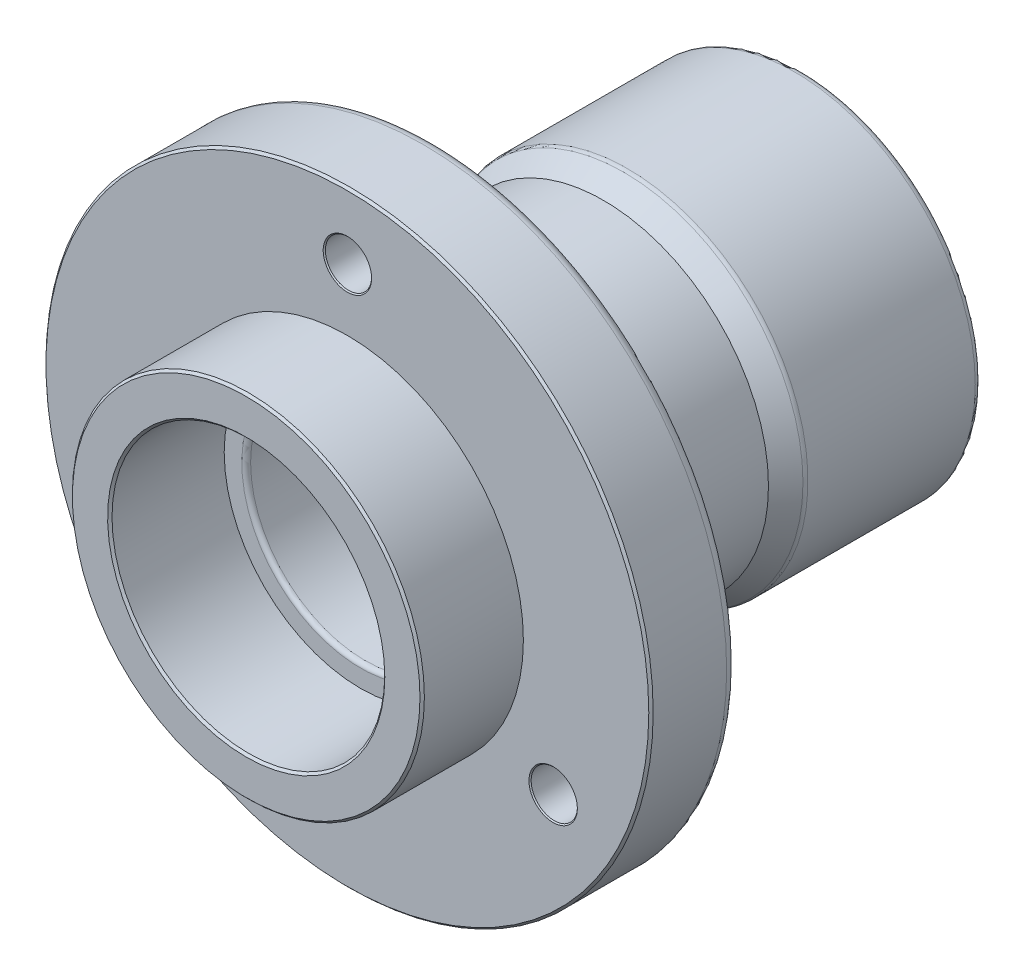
from build123d import *

# Parameters (mm, degrees)
ESQUISSE1_R                               = 41
EXTRUSION1_DEPTH                          = 40
ESQUISSE12_R                              = 37.5
EXTRUSION2_DEPTH                          = 35
ESQUISSE17_R                              = 69
EXTRUSION3_DEPTH                          = 19.7
ESQUISSE18_R                              = 40
EXTRUSION4_DEPTH                          = 23
ESQUISSE20_R                              = 5.25
ENL_V_MAT_EXTRU_1_DEPTH                   = 129.429941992
CHANFREIN4_SIZE                           = 0.25
R_P_TITION_CIRCULAIRE1_COUNT              = 3
CHANFREIN4_OF_R_P_TITION_CIRCULAIRE1_SIZE = 0.25
CONG_1_R                                  = 1.5
CONG_2_R                                  = 1.5
CONG_5_R                                  = 1
CONG_7_R                                  = 2.5
ESQUISSE25_R                              = 36
EXTRUSION5_DEPTH                          = 10
CHANFREIN1_SIZE                           = 0.5


with BuildPart() as part:
    # Esquisse1 → Extrusion1 (new body)
    with BuildSketch(Plane.XY):
        Circle(ESQUISSE1_R)
    extrude(amount=EXTRUSION1_DEPTH)

    # Esquisse9 → R_volution4 (revolve)
    with BuildSketch(Plane(origin=(0, 0, 0), x_dir=(1, 0, 0), z_dir=(0, 1, 0))):
        Polygon((-41, -40), (-37.5, -45), (0, -45), (0, -40), align=None)
    revolve(axis=Axis((0, 0, 26.06314948), (0, 0, 1)))

    # Esquisse12 → Extrusion2 (add)
    with BuildSketch(Plane.XY.offset(45)):
        Circle(ESQUISSE12_R)
    extrude(amount=EXTRUSION2_DEPTH)

    # Esquisse16 → R_volution5 (revolve)
    with BuildSketch(Plane(origin=(0, 0, 0), x_dir=(1, 0, 0), z_dir=(0, 1, 0)), mode=Mode.PRIVATE) as r_volution5_sk:
        Polygon((-40.5, -80), (0, -80), (0, -83.5), (-43.5, -83.5), align=None)
    revolve(r_volution5_sk.sketch.rotate(Axis((0, 0, 59.619426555), (0, 0, 1)), 180), axis=Axis((0, 0, 59.619426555), (0, 0, 1)))

    # Esquisse17 → Extrusion3 (add)
    with BuildSketch(Plane.XY.offset(83.5)):
        Circle(ESQUISSE17_R)
    extrude(amount=EXTRUSION3_DEPTH)

    # Esquisse18 → Extrusion4 (add)
    with BuildSketch(Plane.XY.offset(103.2)):
        Circle(ESQUISSE18_R)
    extrude(amount=EXTRUSION4_DEPTH)

    # Esquisse19 → Enl_vement de mati_re-R_volution1 (revolve, cut)
    with BuildSketch(Plane(origin=(0, 0, 0), x_dir=(0, 0, -1), z_dir=(1, 0, 0))):
        Polygon((-126.2, 0), (-126.2, 31), (-100.2, 31), (-100.2, 26), (-31, 26), (-31, 31), (0, 31), (0, 0), align=None)
    revolve(axis=Axis((0, 0, -26.171030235), (0, 0, 1)), mode=Mode.SUBTRACT)

    # Esquisse20 → Enl_v. mat.-Extru.1 (cut, through all)
    with BuildSketch(Plane.XY.offset(83.5)):
        with Locations((0, 54)):
            Circle(ESQUISSE20_R)
    enl_v_mat_extru_1 = extrude(amount=ENL_V_MAT_EXTRU_1_DEPTH, mode=Mode.SUBTRACT)

    # Chanfrein4
    chanfrein4_edges = [part.edges().sort_by_distance(p)[0] for p in [
        (-5.25, 54, 103.2),
        (-5.25, 54, 83.5),
    ]]
    chamfer(chanfrein4_edges, length=CHANFREIN4_SIZE)

    # R_p_tition circulaire1: Enl_v. mat.-Extru.1 ×3 about axis
    r_p_tition_circulaire1_axis = Axis((0, 0, 0), (0, 0, 1))
    for i in range(1, R_P_TITION_CIRCULAIRE1_COUNT):
        add(enl_v_mat_extru_1.rotate(r_p_tition_circulaire1_axis, i * 360 / R_P_TITION_CIRCULAIRE1_COUNT), mode=Mode.SUBTRACT)

    # Chanfrein4 of R_p_tition circulaire1
    chanfrein4_of_r_p_tition_circulaire1_edges = [part.edges().sort_by_distance(p)[0] for p in [
        (-44.140371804, -31.54663337, 103.2),
        (-44.140371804, -31.54663337, 83.5),
        (49.390371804, -22.45336663, 103.2),
        (49.390371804, -22.45336663, 83.5),
    ]]
    chamfer(chanfrein4_of_r_p_tition_circulaire1_edges, length=CHANFREIN4_OF_R_P_TITION_CIRCULAIRE1_SIZE)

    # Cong_1
    cong_1_edges = [part.edges().sort_by_distance(p)[0] for p in [
        (-41, 0, 0),
    ]]
    fillet(cong_1_edges, radius=CONG_1_R)

    # Cong_2
    cong_2_edges = [part.edges().sort_by_distance(p)[0] for p in [
        (0, -41, 40),
    ]]
    fillet(cong_2_edges, radius=CONG_2_R)

    # Cong_5
    cong_5_edges = [part.edges().sort_by_distance(p)[0] for p in [
        (0, -26, 100.2),
        (0, -26, 31),
    ]]
    fillet(cong_5_edges, radius=CONG_5_R)

    # Cong_7
    cong_7_edges = [part.edges().sort_by_distance(p)[0] for p in [
        (-69, 0, 83.5),
    ]]
    fillet(cong_7_edges, radius=CONG_7_R)

    # Esquisse24 → Gorge pour DIN 472 - 62 x 2_ Circlips ex (revolve, cut)
    with BuildSketch(Plane(origin=(0, 0, -26.171030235), x_dir=(0, 1, 0), z_dir=(-1, 0, 0))):
        with BuildLine():
            Line((32.285, -40.321030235), (31, -40.321030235))
            Line((31, -40.321030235), (31, -38.171030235))
            Line((31, -38.171030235), (32.285, -38.171030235))
            ThreePointArc((32.285, -38.171030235), (32.437027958, -38.234002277), (32.5, -38.386030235))
            Line((32.5, -38.386030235), (32.5, -40.106030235))
            ThreePointArc((32.5, -40.106030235), (32.437027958, -40.258058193), (32.285, -40.321030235))
        make_face()
    revolve(axis=Axis((0, 0, 23.565127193), (0, 0, -1)), mode=Mode.SUBTRACT)

    # Esquisse25 → Extrusion5 (cut)
    with BuildSketch(Plane(origin=(0, 0, 0), x_dir=(-1, 0, 0), z_dir=(0, 0, -1))):
        Circle(ESQUISSE25_R)
    extrude(amount=-EXTRUSION5_DEPTH, mode=Mode.SUBTRACT)

    # Chanfrein1
    chanfrein1_edges = [part.edges().sort_by_distance(p)[0] for p in [
        (-69, 0, 103.2),
        (-40, 0, 126.2),
        (0, -31, 126.2),
        (36, 0, 0),
    ]]
    chamfer(chanfrein1_edges, length=CHANFREIN1_SIZE)


solid = part.part
